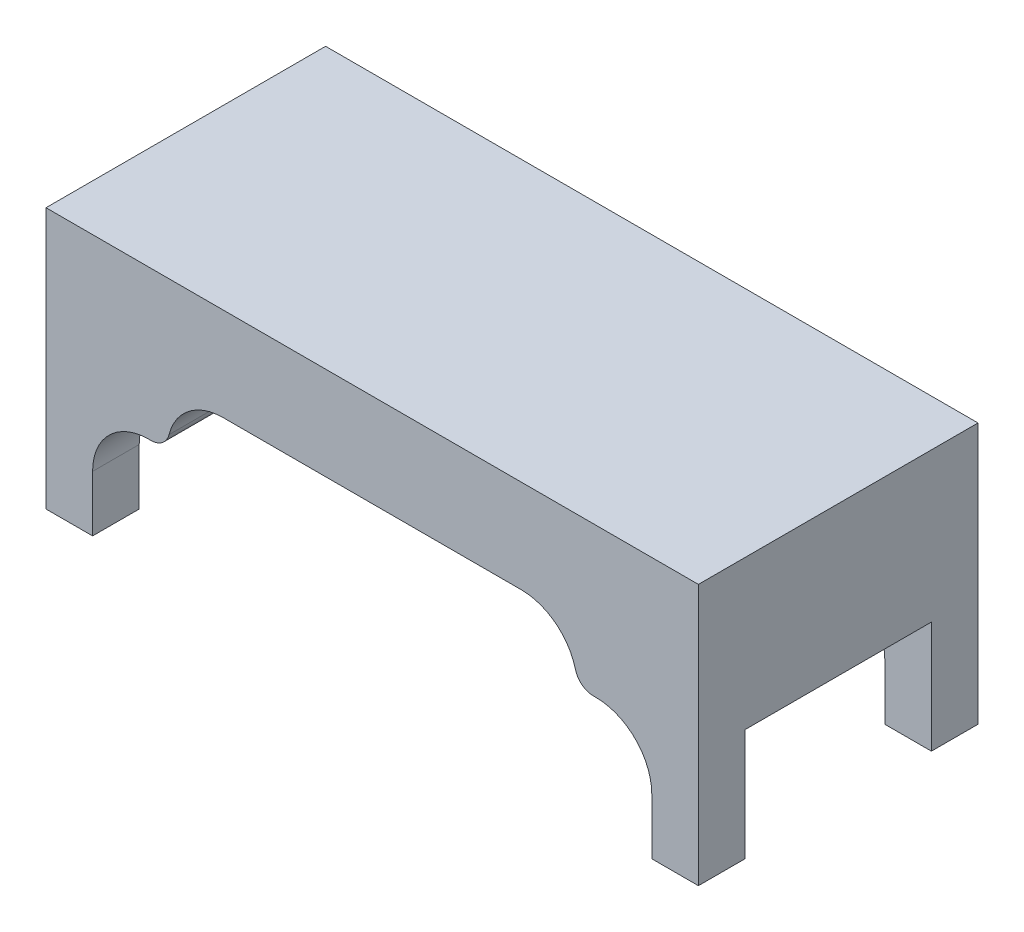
from build123d import *

# Parameters (mm, degrees)
LINEAR_AUSTRAGEN1_DEPTH = 15
SKIZZE3_W               = 2.5
SKIZZE3_H               = 2.5
LINEAR_AUSTRAGEN2_DEPTH = 6
VERRUNDUNG1_R           = 3


with BuildPart() as part:
    # Skizze1 → Linear austragen1 (new body)
    with BuildSketch(Plane.XY):
        with BuildLine():
            Line((-8, 2), (8, 2))
            ThreePointArc((8, 2), (9.837117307, 1.371708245), (10.90473751, -0.25))
            ThreePointArc((10.90473751, -0.25), (11.260610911, -0.790569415), (11.872983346, -1))
            Line((11.872983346, -1), (17.5, -1))
            Line((17.5, -1), (17.5, 7))
            Line((17.5, 7), (-17.5, 7))
            Line((-17.5, 7), (-17.5, -1))
            Line((-17.5, -1), (-11.872983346, -1))
            ThreePointArc((-11.872983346, -1), (-11.260610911, -0.790569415), (-10.90473751, -0.25))
            ThreePointArc((-10.90473751, -0.25), (-9.837117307, 1.371708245), (-8, 2))
        make_face()
    extrude(amount=LINEAR_AUSTRAGEN1_DEPTH)

    # Skizze3 → Linear austragen2 (add)
    with BuildSketch(Plane.XZ.offset(1)):
        with Locations((16.25, 1.25)):
            Rectangle(SKIZZE3_W, SKIZZE3_H)
        with Locations((16.25, 13.75)):
            Rectangle(SKIZZE3_W, SKIZZE3_H)
        with Locations((-16.25, 1.25)):
            Rectangle(SKIZZE3_W, SKIZZE3_H)
        with Locations((-16.25, 13.75)):
            Rectangle(SKIZZE3_W, SKIZZE3_H)
    extrude(amount=LINEAR_AUSTRAGEN2_DEPTH)

    # Verrundung1
    verrundung1_edges = [part.edges().sort_by_distance(p)[0] for p in [
        (15, -1, 1.25),
        (15, -1, 13.75),
        (-15, -1, 1.25),
        (-15, -1, 13.75),
    ]]
    fillet(verrundung1_edges, radius=VERRUNDUNG1_R)


solid = part.part
